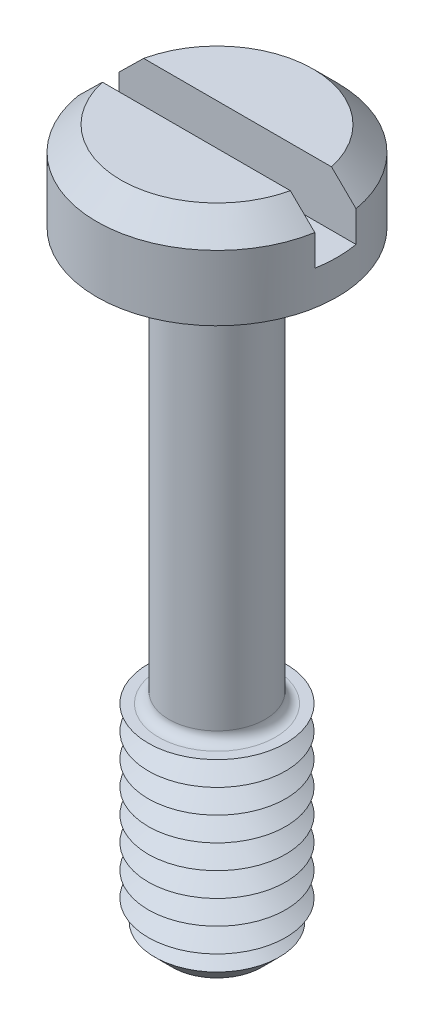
from build123d import *

# Parameters (mm, degrees)
SKETCH1_R           = 3.5
BOSS_EXTRUDE1_DEPTH = 2.6
SKETCH2_R           = 1.4
BOSS_EXTRUDE2_DEPTH = 18
SKETCH3_R           = 2
BOSS_EXTRUDE3_DEPTH = 6
CHAMFER1_SIZE       = 0.7
LPATTERN1_COUNT     = 8
LPATTERN1_PITCH     = 0.7
FILLET1_R           = 0.3
CHAMFER2_SIZE       = 0.7
SKETCH6_W           = 7
SKETCH6_H           = 1.2
CUT_EXTRUDE1_DEPTH  = 1.6


with BuildPart() as part:
    # Sketch1 → Boss-Extrude1 (new body)
    with BuildSketch(Plane(origin=(0, 0, 0), x_dir=(1, 0, 0), z_dir=(0, 1, 0))):
        with Locations(Location((0, 0, 0), (0, 0, 270))):
            Circle(SKETCH1_R)
    extrude(amount=BOSS_EXTRUDE1_DEPTH)

    # Sketch2 → Boss-Extrude2 (add)
    with BuildSketch(Plane.XZ):
        with Locations(Location((0, 0, 0), (0, 0, 270))):
            Circle(SKETCH2_R)
    extrude(amount=BOSS_EXTRUDE2_DEPTH)

    # Sketch3 → Boss-Extrude3 (add)
    with BuildSketch(Plane.XZ.offset(18)):
        with Locations(Location((0, 0, 0), (0, 0, 270))):
            Circle(SKETCH3_R)
    extrude(amount=-BOSS_EXTRUDE3_DEPTH)

    # Chamfer1
    chamfer1_edges = [part.edges().sort_by_distance(p)[0] for p in [
        (0, -18, 2),
    ]]
    chamfer(chamfer1_edges, length=CHAMFER1_SIZE)

    # Sketch5 → Cut-Revolve1 (revolve, cut)
    with BuildSketch(Plane(origin=(0, 0, 0), x_dir=(0, 0, -1), z_dir=(1, 0, 0))):
        Polygon((-2, -12), (-1.393782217, -12.35), (-2, -12.7), align=None)
    cut_revolve1 = revolve(axis=Axis((0, -6.58711856, 0), (0, -1, 0)), mode=Mode.SUBTRACT)

    # LPattern1: Cut-Revolve1 ×8
    with Locations(*[(0, -i * LPATTERN1_PITCH, 0) for i in range(1, LPATTERN1_COUNT)]):
        add(cut_revolve1, mode=Mode.SUBTRACT)

    # Fillet1
    fillet1_edges = [part.edges().sort_by_distance(p)[0] for p in [
        (0, 0, 1.4),
        (0, -12, 1.4),
    ]]
    fillet(fillet1_edges, radius=FILLET1_R)

    # Chamfer2
    chamfer2_edges = [part.edges().sort_by_distance(p)[0] for p in [
        (0, 2.6, -3.5),
    ]]
    chamfer(chamfer2_edges, length=CHAMFER2_SIZE)

    # Sketch6 → Cut-Extrude1 (cut)
    with BuildSketch(Plane(origin=(0, 2.6, 0), x_dir=(1, 0, 0), z_dir=(0, 1, 0))):
        Rectangle(SKETCH6_W, SKETCH6_H)
    extrude(amount=-CUT_EXTRUDE1_DEPTH, mode=Mode.SUBTRACT)


solid = part.part
